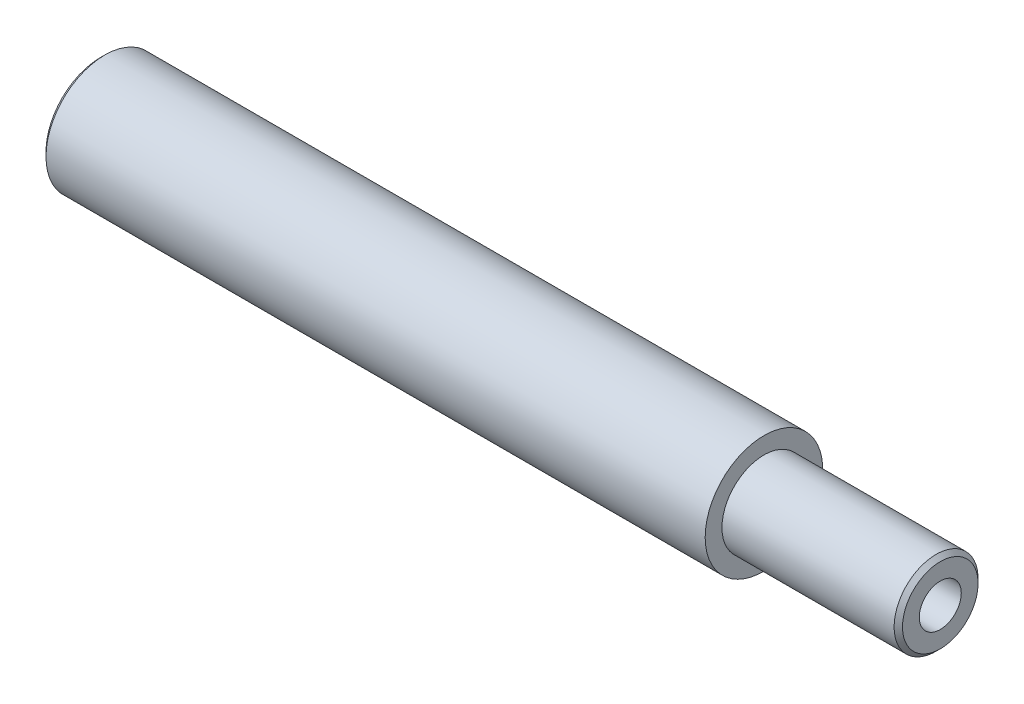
from build123d import *

# Parameters (mm, degrees)
TROU_TARAUD_M61_D     = 5
TROU_TARAUD_M61_DEPTH = 20
TROU_TARAUD_M61_TIP   = 1.502151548
CHANFREIN1_SIZE       = 0.5
TROU_TARAUD_M63_D     = 5
TROU_TARAUD_M63_DEPTH = 20
TROU_TARAUD_M63_TIP   = 1.502151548


with BuildPart() as part:
    # Esquisse1 → R_volution1 (revolve)
    with BuildSketch(Plane.XY, mode=Mode.PRIVATE) as r_volution1_sk:
        Polygon((0, 0), (0, 7), (79, 7), (79, 5), (100, 5), (100, 0), align=None)
    revolve(r_volution1_sk.sketch.rotate(Axis((0, 0, 0), (1, 0, 0)), 90), axis=Axis((0, 0, 0), (1, 0, 0)))

    # Trou taraud_ M61
    with Locations(Plane(origin=(100, 0, 0), x_dir=(0, 0, -1), z_dir=(1, 0, 0))):
        with Locations((0, 0)):
            Hole(TROU_TARAUD_M61_D / 2, depth=TROU_TARAUD_M61_DEPTH)
            with Locations((0, 0, -(TROU_TARAUD_M61_DEPTH + TROU_TARAUD_M61_TIP / 2))):  # 118° drill point
                Cone(0, TROU_TARAUD_M61_D / 2, TROU_TARAUD_M61_TIP, mode=Mode.SUBTRACT)

    # Chanfrein1
    chanfrein1_edges = [part.edges().sort_by_distance(p)[0] for p in [
        (100, 0, -5),
        (0, 0, -7),
    ]]
    chamfer(chanfrein1_edges, length=CHANFREIN1_SIZE)

    # Trou taraud_ M63
    with Locations(Plane.ZY):
        with Locations((0, 0)):
            Hole(TROU_TARAUD_M63_D / 2, depth=TROU_TARAUD_M63_DEPTH)
            with Locations((0, 0, -(TROU_TARAUD_M63_DEPTH + TROU_TARAUD_M63_TIP / 2))):  # 118° drill point
                Cone(0, TROU_TARAUD_M63_D / 2, TROU_TARAUD_M63_TIP, mode=Mode.SUBTRACT)


solid = part.part
